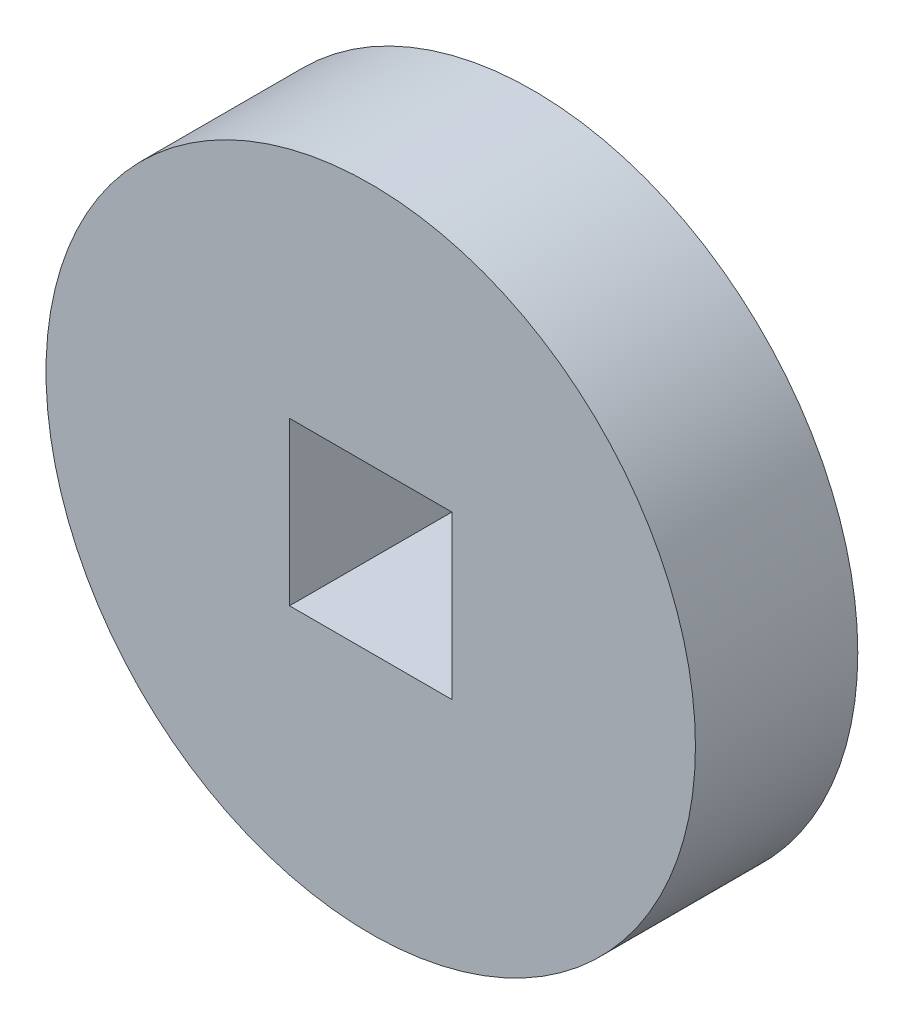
ISO-10303-21;
HEADER;
FILE_DESCRIPTION(('STEP AP214'),'2;1');
FILE_NAME('part.step','',(''),(''),'','','');
FILE_SCHEMA(('AUTOMOTIVE_DESIGN { 1 0 10303 214 1 1 1 1 }'));
ENDSEC;
DATA;
#1=APPLICATION_CONTEXT('core data for automotive mechanical design processes');
#2=APPLICATION_PROTOCOL_DEFINITION('international standard','automotive_design',2000,#1);
#3=PRODUCT_CONTEXT('',#1,'mechanical');
#4=PRODUCT('Part','Part','',(#3));
#5=PRODUCT_RELATED_PRODUCT_CATEGORY('part','',(#4));
#6=PRODUCT_DEFINITION_FORMATION('','',#4);
#7=PRODUCT_DEFINITION_CONTEXT('part definition',#1,'design');
#8=PRODUCT_DEFINITION('design','',#6,#7);
#9=PRODUCT_DEFINITION_SHAPE('','',#8);
#10=(LENGTH_UNIT() NAMED_UNIT(*) SI_UNIT(.MILLI.,.METRE.));
#11=(NAMED_UNIT(*) PLANE_ANGLE_UNIT() SI_UNIT($,.RADIAN.));
#12=(NAMED_UNIT(*) SI_UNIT($,.STERADIAN.) SOLID_ANGLE_UNIT());
#13=UNCERTAINTY_MEASURE_WITH_UNIT(LENGTH_MEASURE(1.E-05),#10,'distance_accuracy_value','');
#14=(GEOMETRIC_REPRESENTATION_CONTEXT(3) GLOBAL_UNCERTAINTY_ASSIGNED_CONTEXT((#13)) GLOBAL_UNIT_ASSIGNED_CONTEXT((#10,
#11,#12)) REPRESENTATION_CONTEXT('',''));
#15=CARTESIAN_POINT('',(0.,0.,0.));
#16=DIRECTION('',(0.,0.,1.));
#17=DIRECTION('',(1.,0.,0.));
#18=AXIS2_PLACEMENT_3D('',#15,#16,#17);
#19=CARTESIAN_POINT('',(0.,0.,6.35));
#20=DIRECTION('',(0.,0.,1.));
#21=DIRECTION('',(1.,0.,0.));
#22=AXIS2_PLACEMENT_3D('',#19,#20,#21);
#23=PLANE('',#22);
#24=CARTESIAN_POINT('',(0.,0.,6.35));
#25=DIRECTION('',(0.,0.,1.));
#26=DIRECTION('',(1.,0.,0.));
#27=AXIS2_PLACEMENT_3D('',#24,#25,#26);
#28=CIRCLE('',#27,12.7);
#29=CARTESIAN_POINT('',(12.7,0.,6.35));
#30=VERTEX_POINT('',#29);
#31=EDGE_CURVE('E11',#30,#30,#28,.T.);
#32=ORIENTED_EDGE('',*,*,#31,.T.);
#33=EDGE_LOOP('',(#32));
#34=FACE_BOUND('',#33,.T.);
#35=DIRECTION('',(-1.,0.,0.));
#36=VECTOR('',#35,1.);
#37=CARTESIAN_POINT('',(-3.175,3.175,6.35));
#38=LINE('',#37,#36);
#39=CARTESIAN_POINT('',(3.175,3.175,6.35));
#40=VERTEX_POINT('',#39);
#41=CARTESIAN_POINT('',(-3.175,3.175,6.35));
#42=VERTEX_POINT('',#41);
#43=EDGE_CURVE('E79',#40,#42,#38,.T.);
#44=ORIENTED_EDGE('',*,*,#43,.F.);
#45=DIRECTION('',(0.,1.,0.));
#46=VECTOR('',#45,1.);
#47=CARTESIAN_POINT('',(3.175,3.175,6.35));
#48=LINE('',#47,#46);
#49=CARTESIAN_POINT('',(3.175,-3.175,6.35));
#50=VERTEX_POINT('',#49);
#51=EDGE_CURVE('E71',#50,#40,#48,.T.);
#52=ORIENTED_EDGE('',*,*,#51,.F.);
#53=DIRECTION('',(1.,0.,0.));
#54=VECTOR('',#53,1.);
#55=CARTESIAN_POINT('',(-3.175,-3.175,6.35));
#56=LINE('',#55,#54);
#57=CARTESIAN_POINT('',(-3.175,-3.175,6.35));
#58=VERTEX_POINT('',#57);
#59=EDGE_CURVE('E92',#58,#50,#56,.T.);
#60=ORIENTED_EDGE('',*,*,#59,.F.);
#61=DIRECTION('',(0.,-1.,0.));
#62=VECTOR('',#61,1.);
#63=CARTESIAN_POINT('',(-3.175,3.175,6.35));
#64=LINE('',#63,#62);
#65=EDGE_CURVE('E90',#42,#58,#64,.T.);
#66=ORIENTED_EDGE('',*,*,#65,.F.);
#67=EDGE_LOOP('',(#44,#52,#60,#66));
#68=FACE_BOUND('',#67,.T.);
#69=ADVANCED_FACE('F30',(#34,#68),#23,.T.);
#70=CARTESIAN_POINT('',(0.,0.,0.));
#71=DIRECTION('',(0.,0.,1.));
#72=DIRECTION('',(1.,0.,0.));
#73=AXIS2_PLACEMENT_3D('',#70,#71,#72);
#74=PLANE('',#73);
#75=CARTESIAN_POINT('',(0.,0.,0.));
#76=DIRECTION('',(0.,0.,1.));
#77=DIRECTION('',(1.,0.,0.));
#78=AXIS2_PLACEMENT_3D('',#75,#76,#77);
#79=CIRCLE('',#78,12.7);
#80=CARTESIAN_POINT('',(12.7,0.,0.));
#81=VERTEX_POINT('',#80);
#82=EDGE_CURVE('E34',#81,#81,#79,.T.);
#83=ORIENTED_EDGE('',*,*,#82,.F.);
#84=EDGE_LOOP('',(#83));
#85=FACE_BOUND('',#84,.T.);
#86=DIRECTION('',(0.,1.,0.));
#87=VECTOR('',#86,1.);
#88=CARTESIAN_POINT('',(3.175,3.175,0.));
#89=LINE('',#88,#87);
#90=CARTESIAN_POINT('',(3.175,-3.175,0.));
#91=VERTEX_POINT('',#90);
#92=CARTESIAN_POINT('',(3.175,3.175,0.));
#93=VERTEX_POINT('',#92);
#94=EDGE_CURVE('E53',#91,#93,#89,.T.);
#95=ORIENTED_EDGE('',*,*,#94,.T.);
#96=DIRECTION('',(-1.,0.,0.));
#97=VECTOR('',#96,1.);
#98=CARTESIAN_POINT('',(-3.175,3.175,0.));
#99=LINE('',#98,#97);
#100=CARTESIAN_POINT('',(-3.175,3.175,0.));
#101=VERTEX_POINT('',#100);
#102=EDGE_CURVE('E86',#93,#101,#99,.T.);
#103=ORIENTED_EDGE('',*,*,#102,.T.);
#104=DIRECTION('',(0.,-1.,0.));
#105=VECTOR('',#104,1.);
#106=CARTESIAN_POINT('',(-3.175,3.175,0.));
#107=LINE('',#106,#105);
#108=CARTESIAN_POINT('',(-3.175,-3.175,0.));
#109=VERTEX_POINT('',#108);
#110=EDGE_CURVE('E98',#101,#109,#107,.T.);
#111=ORIENTED_EDGE('',*,*,#110,.T.);
#112=DIRECTION('',(1.,0.,0.));
#113=VECTOR('',#112,1.);
#114=CARTESIAN_POINT('',(-3.175,-3.175,0.));
#115=LINE('',#114,#113);
#116=EDGE_CURVE('E80',#109,#91,#115,.T.);
#117=ORIENTED_EDGE('',*,*,#116,.T.);
#118=EDGE_LOOP('',(#95,#103,#111,#117));
#119=FACE_BOUND('',#118,.T.);
#120=ADVANCED_FACE('F109',(#85,#119),#74,.F.);
#121=CARTESIAN_POINT('',(0.,0.,6.35));
#122=DIRECTION('',(0.,0.,-1.));
#123=DIRECTION('',(-1.,0.,0.));
#124=AXIS2_PLACEMENT_3D('',#121,#122,#123);
#125=CYLINDRICAL_SURFACE('',#124,12.7);
#126=ORIENTED_EDGE('',*,*,#31,.F.);
#127=EDGE_LOOP('',(#126));
#128=FACE_BOUND('',#127,.T.);
#129=ORIENTED_EDGE('',*,*,#82,.T.);
#130=EDGE_LOOP('',(#129));
#131=FACE_BOUND('',#130,.T.);
#132=ADVANCED_FACE('F32',(#128,#131),#125,.T.);
#133=CARTESIAN_POINT('',(3.175,3.175,6.35));
#134=DIRECTION('',(-1.,0.,0.));
#135=DIRECTION('',(0.,-1.,0.));
#136=AXIS2_PLACEMENT_3D('',#133,#134,#135);
#137=PLANE('',#136);
#138=ORIENTED_EDGE('',*,*,#94,.F.);
#139=DIRECTION('',(0.,0.,-1.));
#140=VECTOR('',#139,1.);
#141=CARTESIAN_POINT('',(3.175,-3.175,6.35));
#142=LINE('',#141,#140);
#143=EDGE_CURVE('E75',#50,#91,#142,.T.);
#144=ORIENTED_EDGE('',*,*,#143,.F.);
#145=ORIENTED_EDGE('',*,*,#51,.T.);
#146=DIRECTION('',(0.,0.,-1.));
#147=VECTOR('',#146,1.);
#148=CARTESIAN_POINT('',(3.175,3.175,6.35));
#149=LINE('',#148,#147);
#150=EDGE_CURVE('E74',#40,#93,#149,.T.);
#151=ORIENTED_EDGE('',*,*,#150,.T.);
#152=EDGE_LOOP('',(#138,#144,#145,#151));
#153=FACE_BOUND('',#152,.T.);
#154=ADVANCED_FACE('F73',(#153),#137,.T.);
#155=CARTESIAN_POINT('',(-3.175,3.175,6.35));
#156=DIRECTION('',(0.,-1.,0.));
#157=DIRECTION('',(0.,0.,-1.));
#158=AXIS2_PLACEMENT_3D('',#155,#156,#157);
#159=PLANE('',#158);
#160=ORIENTED_EDGE('',*,*,#102,.F.);
#161=ORIENTED_EDGE('',*,*,#150,.F.);
#162=ORIENTED_EDGE('',*,*,#43,.T.);
#163=DIRECTION('',(0.,0.,-1.));
#164=VECTOR('',#163,1.);
#165=CARTESIAN_POINT('',(-3.175,3.175,6.35));
#166=LINE('',#165,#164);
#167=EDGE_CURVE('E87',#42,#101,#166,.T.);
#168=ORIENTED_EDGE('',*,*,#167,.T.);
#169=EDGE_LOOP('',(#160,#161,#162,#168));
#170=FACE_BOUND('',#169,.T.);
#171=ADVANCED_FACE('F83',(#170),#159,.T.);
#172=CARTESIAN_POINT('',(-3.175,3.175,6.35));
#173=DIRECTION('',(1.,0.,0.));
#174=DIRECTION('',(0.,1.,0.));
#175=AXIS2_PLACEMENT_3D('',#172,#173,#174);
#176=PLANE('',#175);
#177=ORIENTED_EDGE('',*,*,#110,.F.);
#178=ORIENTED_EDGE('',*,*,#167,.F.);
#179=ORIENTED_EDGE('',*,*,#65,.T.);
#180=DIRECTION('',(0.,0.,-1.));
#181=VECTOR('',#180,1.);
#182=CARTESIAN_POINT('',(-3.175,-3.175,6.35));
#183=LINE('',#182,#181);
#184=EDGE_CURVE('E45',#58,#109,#183,.T.);
#185=ORIENTED_EDGE('',*,*,#184,.T.);
#186=EDGE_LOOP('',(#177,#178,#179,#185));
#187=FACE_BOUND('',#186,.T.);
#188=ADVANCED_FACE('F107',(#187),#176,.T.);
#189=CARTESIAN_POINT('',(-3.175,-3.175,6.35));
#190=DIRECTION('',(0.,1.,0.));
#191=DIRECTION('',(0.,0.,1.));
#192=AXIS2_PLACEMENT_3D('',#189,#190,#191);
#193=PLANE('',#192);
#194=ORIENTED_EDGE('',*,*,#116,.F.);
#195=ORIENTED_EDGE('',*,*,#184,.F.);
#196=ORIENTED_EDGE('',*,*,#59,.T.);
#197=ORIENTED_EDGE('',*,*,#143,.T.);
#198=EDGE_LOOP('',(#194,#195,#196,#197));
#199=FACE_BOUND('',#198,.T.);
#200=ADVANCED_FACE('F110',(#199),#193,.T.);
#201=CLOSED_SHELL('',(#69,#120,#132,#154,#171,#188,#200));
#202=MANIFOLD_SOLID_BREP('B2',#201);
#203=ADVANCED_BREP_SHAPE_REPRESENTATION('',(#18,#202),#14);
#204=SHAPE_DEFINITION_REPRESENTATION(#9,#203);
ENDSEC;
END-ISO-10303-21;
